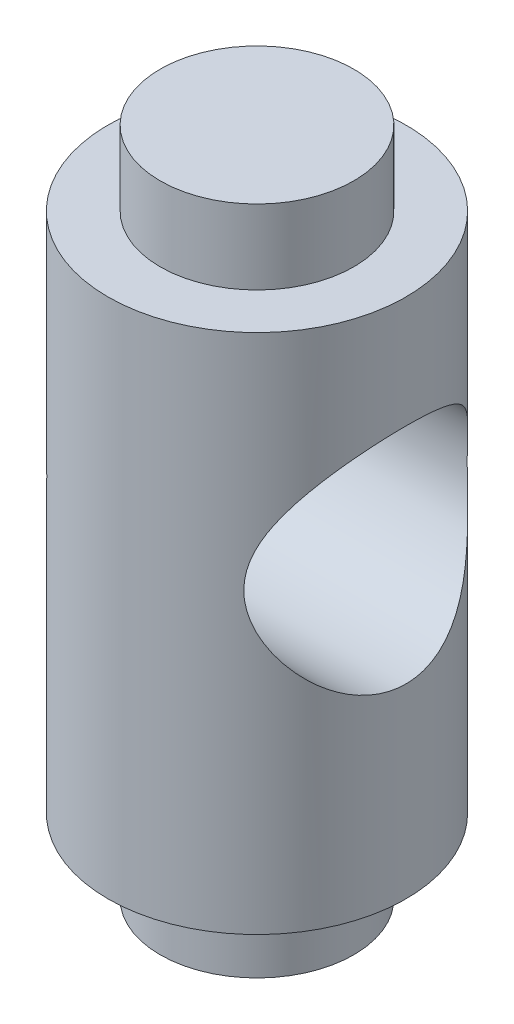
ISO-10303-21;
HEADER;
FILE_DESCRIPTION(('STEP AP214'),'2;1');
FILE_NAME('part.step','',(''),(''),'','','');
FILE_SCHEMA(('AUTOMOTIVE_DESIGN { 1 0 10303 214 1 1 1 1 }'));
ENDSEC;
DATA;
#1=APPLICATION_CONTEXT('core data for automotive mechanical design processes');
#2=APPLICATION_PROTOCOL_DEFINITION('international standard','automotive_design',2000,#1);
#3=PRODUCT_CONTEXT('',#1,'mechanical');
#4=PRODUCT('Part','Part','',(#3));
#5=PRODUCT_RELATED_PRODUCT_CATEGORY('part','',(#4));
#6=PRODUCT_DEFINITION_FORMATION('','',#4);
#7=PRODUCT_DEFINITION_CONTEXT('part definition',#1,'design');
#8=PRODUCT_DEFINITION('design','',#6,#7);
#9=PRODUCT_DEFINITION_SHAPE('','',#8);
#10=(LENGTH_UNIT() NAMED_UNIT(*) SI_UNIT(.MILLI.,.METRE.));
#11=(NAMED_UNIT(*) PLANE_ANGLE_UNIT() SI_UNIT($,.RADIAN.));
#12=(NAMED_UNIT(*) SI_UNIT($,.STERADIAN.) SOLID_ANGLE_UNIT());
#13=UNCERTAINTY_MEASURE_WITH_UNIT(LENGTH_MEASURE(1.E-05),#10,'distance_accuracy_value','');
#14=(GEOMETRIC_REPRESENTATION_CONTEXT(3) GLOBAL_UNCERTAINTY_ASSIGNED_CONTEXT((#13)) GLOBAL_UNIT_ASSIGNED_CONTEXT((#10,
#11,#12)) REPRESENTATION_CONTEXT('',''));
#15=CARTESIAN_POINT('',(0.,0.,0.));
#16=DIRECTION('',(0.,0.,1.));
#17=DIRECTION('',(1.,0.,0.));
#18=AXIS2_PLACEMENT_3D('',#15,#16,#17);
#19=CARTESIAN_POINT('',(0.,22.5,0.));
#20=DIRECTION('',(0.,1.,0.));
#21=DIRECTION('',(0.,0.,1.));
#22=AXIS2_PLACEMENT_3D('',#19,#20,#21);
#23=CYLINDRICAL_SURFACE('',#22,9.99999999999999);
#24=CARTESIAN_POINT('',(0.,-17.5,0.));
#25=DIRECTION('',(0.,1.,0.));
#26=DIRECTION('',(0.,0.,1.));
#27=AXIS2_PLACEMENT_3D('',#24,#25,#26);
#28=CIRCLE('',#27,9.99999999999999);
#29=CARTESIAN_POINT('',(0.,-17.5,9.99999999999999));
#30=VERTEX_POINT('',#29);
#31=EDGE_CURVE('E94',#30,#30,#28,.T.);
#32=ORIENTED_EDGE('',*,*,#31,.T.);
#33=EDGE_LOOP('',(#32));
#34=FACE_BOUND('',#33,.T.);
#35=CARTESIAN_POINT('',(0.,17.5,0.));
#36=DIRECTION('',(0.,1.,0.));
#37=DIRECTION('',(0.,0.,1.));
#38=AXIS2_PLACEMENT_3D('',#35,#36,#37);
#39=CIRCLE('',#38,9.99999999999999);
#40=CARTESIAN_POINT('',(0.,17.5,9.99999999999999));
#41=VERTEX_POINT('',#40);
#42=EDGE_CURVE('E96',#41,#41,#39,.T.);
#43=ORIENTED_EDGE('',*,*,#42,.F.);
#44=EDGE_LOOP('',(#43));
#45=FACE_BOUND('',#44,.T.);
#46=CARTESIAN_POINT('',(-6.61437827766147,2.5,7.5));
#47=CARTESIAN_POINT('',(-6.6143819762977,2.32495725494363,7.49999838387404));
#48=CARTESIAN_POINT('',(-6.62136678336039,2.1498808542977,7.4938544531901));
#49=CARTESIAN_POINT('',(-6.64887553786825,1.801629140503,7.46945630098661));
#50=CARTESIAN_POINT('',(-6.66940400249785,1.62845448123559,7.45119803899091));
#51=CARTESIAN_POINT('',(-6.72284656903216,1.28531073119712,7.40301431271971));
#52=CARTESIAN_POINT('',(-6.75578799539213,1.11534958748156,7.37306310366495));
#53=CARTESIAN_POINT('',(-6.83236869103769,0.780137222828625,7.30215402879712));
#54=CARTESIAN_POINT('',(-6.87601440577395,0.61488890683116,7.26118953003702));
#55=CARTESIAN_POINT('',(-6.97141228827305,0.292284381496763,7.16963772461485));
#56=CARTESIAN_POINT('',(-7.02303888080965,0.134848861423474,7.11919724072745));
#57=CARTESIAN_POINT('',(-7.13305481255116,-0.174192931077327,7.00896652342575));
#58=CARTESIAN_POINT('',(-7.19144339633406,-0.32579985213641,6.94917733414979));
#59=CARTESIAN_POINT('',(-7.37426489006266,-0.771608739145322,6.75658060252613));
#60=CARTESIAN_POINT('',(-7.50643092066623,-1.0570438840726,6.61047289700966));
#61=CARTESIAN_POINT('',(-7.72612312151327,-1.49541081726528,6.35008921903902));
#62=CARTESIAN_POINT('',(-7.8106651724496,-1.65615316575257,6.24603009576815));
#63=CARTESIAN_POINT('',(-7.98137144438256,-1.96871903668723,6.02636084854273));
#64=CARTESIAN_POINT('',(-8.06753579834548,-2.12054182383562,5.91074977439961));
#65=CARTESIAN_POINT('',(-8.23983652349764,-2.41520104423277,5.66809334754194));
#66=CARTESIAN_POINT('',(-8.32597267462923,-2.55802418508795,5.54103172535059));
#67=CARTESIAN_POINT('',(-8.49650996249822,-2.83408445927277,5.27581060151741));
#68=CARTESIAN_POINT('',(-8.58091109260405,-2.96732155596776,5.1376510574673));
#69=CARTESIAN_POINT('',(-8.76343118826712,-3.2499246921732,4.8210103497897));
#70=CARTESIAN_POINT('',(-8.86082412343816,-3.39701404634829,4.64006256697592));
#71=CARTESIAN_POINT('',(-9.04840053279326,-3.67528183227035,4.26272756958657));
#72=CARTESIAN_POINT('',(-9.13858238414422,-3.8064566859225,4.06633689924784));
#73=CARTESIAN_POINT('',(-9.30904597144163,-4.05103109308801,3.65927040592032));
#74=CARTESIAN_POINT('',(-9.389346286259,-4.16446411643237,3.44862258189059));
#75=CARTESIAN_POINT('',(-9.53775182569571,-4.37196979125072,3.01395872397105));
#76=CARTESIAN_POINT('',(-9.60586349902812,-4.4660526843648,2.78994984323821));
#77=CARTESIAN_POINT('',(-9.70920590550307,-4.60776033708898,2.39977112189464));
#78=CARTESIAN_POINT('',(-9.7481569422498,-4.66083762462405,2.23654263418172));
#79=CARTESIAN_POINT('',(-9.81827338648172,-4.75599960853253,1.90529321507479));
#80=CARTESIAN_POINT('',(-9.84944065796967,-4.7980869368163,1.73727344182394));
#81=CARTESIAN_POINT('',(-9.90335558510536,-4.87068804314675,1.39753765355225));
#82=CARTESIAN_POINT('',(-9.92610885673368,-4.90120954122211,1.22582418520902));
#83=CARTESIAN_POINT('',(-9.96274691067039,-4.95027468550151,0.879743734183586));
#84=CARTESIAN_POINT('',(-9.97663137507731,-4.96881790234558,0.705376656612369));
#85=CARTESIAN_POINT('',(-9.99524834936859,-4.99366784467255,0.354821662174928));
#86=CARTESIAN_POINT('',(-9.99995678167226,-4.99994237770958,0.178630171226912));
#87=CARTESIAN_POINT('',(-10.000042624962,-5.00005683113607,-0.173758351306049));
#88=CARTESIAN_POINT('',(-9.99542007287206,-4.99389680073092,-0.34995538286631));
#89=CARTESIAN_POINT('',(-9.97694670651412,-4.96923905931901,-0.701027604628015));
#90=CARTESIAN_POINT('',(-9.96309406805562,-4.95073890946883,-0.875902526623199));
#91=CARTESIAN_POINT('',(-9.9264665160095,-4.9016891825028,-1.22299713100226));
#92=CARTESIAN_POINT('',(-9.90369166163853,-4.87113968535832,-1.39521683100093));
#93=CARTESIAN_POINT('',(-9.85063449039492,-4.7996954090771,-1.72994463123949));
#94=CARTESIAN_POINT('',(-9.82063888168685,-4.759194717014,-1.89258265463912));
#95=CARTESIAN_POINT('',(-9.7533432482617,-4.66789010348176,-2.21341583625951));
#96=CARTESIAN_POINT('',(-9.71604068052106,-4.61708259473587,-2.37160942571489));
#97=CARTESIAN_POINT('',(-9.59413977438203,-4.45006274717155,-2.83823794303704));
#98=CARTESIAN_POINT('',(-9.49950846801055,-4.31920036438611,-3.13896269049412));
#99=CARTESIAN_POINT('',(-9.27804864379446,-4.00734387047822,-3.74612986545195));
#100=CARTESIAN_POINT('',(-9.14884335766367,-3.8224558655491,-4.0496657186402));
#101=CARTESIAN_POINT('',(-8.87301878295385,-3.41631511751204,-4.62284746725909));
#102=CARTESIAN_POINT('',(-8.72638468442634,-3.19503138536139,-4.89246413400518));
#103=CARTESIAN_POINT('',(-8.48504273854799,-2.81581411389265,-5.29480881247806));
#104=CARTESIAN_POINT('',(-8.39310925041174,-2.66809085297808,-5.43905294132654));
#105=CARTESIAN_POINT('',(-8.20797296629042,-2.36166142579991,-5.71460427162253));
#106=CARTESIAN_POINT('',(-8.11476992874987,-2.20295314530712,-5.84590897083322));
#107=CARTESIAN_POINT('',(-7.92914991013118,-1.87489703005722,-6.09530688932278));
#108=CARTESIAN_POINT('',(-7.83673337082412,-1.70554361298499,-6.21339308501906));
#109=CARTESIAN_POINT('',(-7.65507530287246,-1.35647449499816,-6.43587029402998));
#110=CARTESIAN_POINT('',(-7.56583306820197,-1.17676112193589,-6.54026436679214));
#111=CARTESIAN_POINT('',(-7.41026277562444,-0.843530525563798,-6.7155722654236));
#112=CARTESIAN_POINT('',(-7.34288681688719,-0.691837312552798,-6.78902852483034));
#113=CARTESIAN_POINT('',(-7.21353507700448,-0.381828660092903,-6.92631258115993));
#114=CARTESIAN_POINT('',(-7.1515610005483,-0.22351115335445,-6.9901373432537));
#115=CARTESIAN_POINT('',(-7.034994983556,0.0992189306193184,-7.10743795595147));
#116=CARTESIAN_POINT('',(-6.98039000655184,0.263620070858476,-7.16093215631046));
#117=CARTESIAN_POINT('',(-6.88048971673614,0.598266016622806,-7.25697383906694));
#118=CARTESIAN_POINT('',(-6.83518774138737,0.768506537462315,-7.29952916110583));
#119=CARTESIAN_POINT('',(-6.76376361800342,1.0798934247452,-7.36568941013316));
#120=CARTESIAN_POINT('',(-6.73562014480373,1.22013435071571,-7.39137773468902));
#121=CARTESIAN_POINT('',(-6.68761574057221,1.5031878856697,-7.43484020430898));
#122=CARTESIAN_POINT('',(-6.66775069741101,1.6459991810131,-7.45261827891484));
#123=CARTESIAN_POINT('',(-6.63708025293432,1.93325219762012,-7.47994591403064));
#124=CARTESIAN_POINT('',(-6.62626668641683,2.07769233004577,-7.48950289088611));
#125=CARTESIAN_POINT('',(-6.61412778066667,2.36728908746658,-7.50022540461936));
#126=CARTESIAN_POINT('',(-6.61280253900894,2.51244571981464,-7.50139085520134));
#127=CARTESIAN_POINT('',(-6.61970015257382,2.8023994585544,-7.49530453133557));
#128=CARTESIAN_POINT('',(-6.62792615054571,2.94719643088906,-7.4880499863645));
#129=CARTESIAN_POINT('',(-6.65357632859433,3.23530434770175,-7.46526710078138));
#130=CARTESIAN_POINT('',(-6.67100051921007,3.37861529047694,-7.44973875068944));
#131=CARTESIAN_POINT('',(-6.71437252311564,3.66300453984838,-7.41067135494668));
#132=CARTESIAN_POINT('',(-6.74033089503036,3.80407985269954,-7.38712238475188));
#133=CARTESIAN_POINT('',(-6.79983969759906,4.08317138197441,-7.33238101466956));
#134=CARTESIAN_POINT('',(-6.83339455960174,4.22118576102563,-7.30118415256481));
#135=CARTESIAN_POINT('',(-6.92081343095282,4.54453327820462,-7.21853070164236));
#136=CARTESIAN_POINT('',(-6.97758010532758,4.72826531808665,-7.16386030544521));
#137=CARTESIAN_POINT('',(-7.10070244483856,5.08816900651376,-7.04184138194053));
#138=CARTESIAN_POINT('',(-7.16706274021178,5.26433695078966,-6.97448672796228));
#139=CARTESIAN_POINT('',(-7.30690755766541,5.60897695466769,-6.82783857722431));
#140=CARTESIAN_POINT('',(-7.38040159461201,5.77743828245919,-6.74852905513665));
#141=CARTESIAN_POINT('',(-7.53219738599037,6.10628224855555,-6.57867589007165));
#142=CARTESIAN_POINT('',(-7.61049870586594,6.26666561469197,-6.48813326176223));
#143=CARTESIAN_POINT('',(-7.77280857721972,6.58484159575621,-6.29286343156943));
#144=CARTESIAN_POINT('',(-7.85692102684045,6.74234264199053,-6.1877481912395));
#145=CARTESIAN_POINT('',(-8.02641315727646,7.04857908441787,-5.96625095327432));
#146=CARTESIAN_POINT('',(-8.11179326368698,7.19731144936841,-5.8498650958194));
#147=CARTESIAN_POINT('',(-8.28217070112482,7.48576938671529,-5.60604802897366));
#148=CARTESIAN_POINT('',(-8.36716790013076,7.62549204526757,-5.47861327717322));
#149=CARTESIAN_POINT('',(-8.53523072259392,7.8954907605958,-5.21292172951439));
#150=CARTESIAN_POINT('',(-8.61829632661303,8.02576672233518,-5.07466482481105));
#151=CARTESIAN_POINT('',(-8.79886280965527,8.3037464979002,-4.75609627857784));
#152=CARTESIAN_POINT('',(-8.89555017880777,8.4490352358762,-4.57319795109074));
#153=CARTESIAN_POINT('',(-9.08140583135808,8.72351369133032,-4.19202039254));
#154=CARTESIAN_POINT('',(-9.17057240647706,8.85269975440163,-3.99373768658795));
#155=CARTESIAN_POINT('',(-9.33871511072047,9.09309973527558,-3.58295524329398));
#156=CARTESIAN_POINT('',(-9.41770839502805,9.20434399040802,-3.37048038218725));
#157=CARTESIAN_POINT('',(-9.56319061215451,9.40721459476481,-2.93233430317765));
#158=CARTESIAN_POINT('',(-9.62968629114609,9.49885153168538,-2.7066702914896));
#159=CARTESIAN_POINT('',(-9.72986513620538,9.63594683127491,-2.31458682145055));
#160=CARTESIAN_POINT('',(-9.76737290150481,9.68696832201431,-2.15106438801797));
#161=CARTESIAN_POINT('',(-9.83454643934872,9.77799769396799,-1.81942149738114));
#162=CARTESIAN_POINT('',(-9.8642140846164,9.81800820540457,-1.6513021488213));
#163=CARTESIAN_POINT('',(-9.91510086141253,9.88645709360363,-1.31158500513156));
#164=CARTESIAN_POINT('',(-9.93632589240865,9.91490355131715,-1.13998972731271));
#165=CARTESIAN_POINT('',(-9.96991081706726,9.95984888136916,-0.794368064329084));
#166=CARTESIAN_POINT('',(-9.98227037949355,9.97634730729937,-0.620341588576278));
#167=CARTESIAN_POINT('',(-9.99786922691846,9.99716192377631,-0.270737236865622));
#168=CARTESIAN_POINT('',(-10.0010868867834,10.0014492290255,-0.0951566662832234));
#169=CARTESIAN_POINT('',(-9.99826797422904,9.99769057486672,0.25579645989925));
#170=CARTESIAN_POINT('',(-9.99223144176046,9.9896446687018,0.431169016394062));
#171=CARTESIAN_POINT('',(-9.97103698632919,9.96134480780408,0.780405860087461));
#172=CARTESIAN_POINT('',(-9.95587700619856,9.94108809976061,0.954269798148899));
#173=CARTESIAN_POINT('',(-9.91676635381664,9.88867771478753,1.29918219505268));
#174=CARTESIAN_POINT('',(-9.89281570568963,9.85652407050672,1.47023066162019));
#175=CARTESIAN_POINT('',(-9.83744673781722,9.78189307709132,1.80341707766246));
#176=CARTESIAN_POINT('',(-9.8062681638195,9.73974634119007,1.96566921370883));
#177=CARTESIAN_POINT('',(-9.7366786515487,9.64520309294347,2.28559292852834));
#178=CARTESIAN_POINT('',(-9.69826518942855,9.59280300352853,2.44326288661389));
#179=CARTESIAN_POINT('',(-9.57316299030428,9.4211022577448,2.90814334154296));
#180=CARTESIAN_POINT('',(-9.47657095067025,9.28724605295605,3.20746548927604));
#181=CARTESIAN_POINT('',(-9.25087814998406,8.9686016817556,3.81278372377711));
#182=CARTESIAN_POINT('',(-9.11933431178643,8.7797616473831,4.11569486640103));
#183=CARTESIAN_POINT('',(-8.83925861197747,8.36565147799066,4.68708538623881));
#184=CARTESIAN_POINT('',(-8.69071117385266,8.14034786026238,4.95553270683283));
#185=CARTESIAN_POINT('',(-8.44671829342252,7.75447653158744,5.35573297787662));
#186=CARTESIAN_POINT('',(-8.3538469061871,7.60414606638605,5.49915593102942));
#187=CARTESIAN_POINT('',(-8.16710630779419,7.29241369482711,5.7728494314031));
#188=CARTESIAN_POINT('',(-8.07323689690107,7.13100953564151,5.90311728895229));
#189=CARTESIAN_POINT('',(-7.88663999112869,6.79746571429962,6.15019469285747));
#190=CARTESIAN_POINT('',(-7.79391302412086,6.62532129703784,6.26699821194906));
#191=CARTESIAN_POINT('',(-7.61208490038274,6.2705492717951,6.48663766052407));
#192=CARTESIAN_POINT('',(-7.52298281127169,6.08792438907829,6.58947719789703));
#193=CARTESIAN_POINT('',(-7.36980342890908,5.75286478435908,6.75989283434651));
#194=CARTESIAN_POINT('',(-7.30447828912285,5.60243084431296,6.83028750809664));
#195=CARTESIAN_POINT('',(-7.17937554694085,5.29519765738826,6.9616658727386));
#196=CARTESIAN_POINT('',(-7.11959923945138,5.13839693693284,7.02264736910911));
#197=CARTESIAN_POINT('',(-7.00753877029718,4.81902463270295,7.1344699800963));
#198=CARTESIAN_POINT('',(-6.95523768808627,4.65646715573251,7.18533410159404));
#199=CARTESIAN_POINT('',(-6.85992197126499,4.32582318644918,7.2763865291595));
#200=CARTESIAN_POINT('',(-6.81690335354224,4.15773910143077,7.31657941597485));
#201=CARTESIAN_POINT('',(-6.72665035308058,3.74611764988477,7.39982855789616));
#202=CARTESIAN_POINT('',(-6.685011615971,3.50008621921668,7.4372125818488));
#203=CARTESIAN_POINT('',(-6.64288211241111,3.12710902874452,7.47478587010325));
#204=CARTESIAN_POINT('',(-6.63222701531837,3.00212059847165,7.48422651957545));
#205=CARTESIAN_POINT('',(-6.61797427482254,2.75142716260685,7.49683371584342));
#206=CARTESIAN_POINT('',(-6.61437562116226,2.62572226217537,7.50000116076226));
#207=CARTESIAN_POINT('',(-6.61437827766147,2.5,7.5));
#208=B_SPLINE_CURVE_WITH_KNOTS('',3,(#46,#47,#48,#49,#50,#51,#52,#53,#54,#55,#56,#57,#58,#59,
#60,#61,#62,#63,#64,#65,#66,#67,#68,#69,#70,#71,#72,#73,#74,#75,#76,#77,#78,#79,#80,#81,#82,#83,
#84,#85,#86,#87,#88,#89,#90,#91,#92,#93,#94,#95,#96,#97,#98,#99,#100,#101,#102,#103,#104,#105,
#106,#107,#108,#109,#110,#111,#112,#113,#114,#115,#116,#117,#118,#119,#120,#121,#122,#123,#124,
#125,#126,#127,#128,#129,#130,#131,#132,#133,#134,#135,#136,#137,#138,#139,#140,#141,#142,#143,
#144,#145,#146,#147,#148,#149,#150,#151,#152,#153,#154,#155,#156,#157,#158,#159,#160,#161,#162,
#163,#164,#165,#166,#167,#168,#169,#170,#171,#172,#173,#174,#175,#176,#177,#178,#179,#180,#181,
#182,#183,#184,#185,#186,#187,#188,#189,#190,#191,#192,#193,#194,#195,#196,#197,#198,#199,#200,
#201,#202,#203,#204,#205,#206,#207),.UNSPECIFIED.,.T.,.F.,(4,2,2,2,2,2,2,2,2,2,2,2,2,2,2,2,2,2,
2,2,2,2,2,2,2,2,2,2,2,2,2,2,2,2,2,2,2,2,2,2,2,2,2,2,2,2,2,2,2,2,2,2,2,2,2,2,2,2,2,2,2,2,2,2,2,2,
2,2,2,2,2,2,2,2,2,2,2,2,2,2,4),(0.,0.524946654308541,1.05006848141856,1.57635306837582,
2.10295533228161,2.62198622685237,3.14095919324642,4.17811218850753,4.80566508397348,
5.43326964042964,6.061780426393,6.69029361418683,7.44738762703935,8.20465154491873,
8.96046919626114,9.71588577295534,10.2433789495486,10.7707456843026,11.2977597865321,
11.8247927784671,12.3532068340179,12.8816187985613,13.4101352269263,13.9386481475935,
14.448892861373,14.9593154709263,15.9794159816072,17.1099698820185,18.2414914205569,
18.9189650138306,19.5965693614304,20.2745320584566,20.9523430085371,21.4964710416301,
22.0407701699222,22.5840934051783,23.1270261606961,23.5625720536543,23.9979013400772,
24.4328374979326,24.8677781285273,25.3028619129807,25.7379461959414,26.1735708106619,
26.609450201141,27.2082971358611,27.8074340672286,28.4073813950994,29.0072745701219,
29.6283553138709,30.2496495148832,30.8711436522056,31.4926440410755,32.2499956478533,
33.0075188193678,33.7637473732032,34.5195665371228,35.0451096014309,35.57052701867,
36.0955766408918,36.6206458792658,37.1469561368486,37.6732641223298,38.1996908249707,
38.7261160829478,39.2370944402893,39.7482513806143,40.7698210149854,41.9071133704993,
43.045456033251,43.7276445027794,44.4099721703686,45.0926041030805,45.7750593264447,
46.3100858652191,46.8452369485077,47.3791568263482,47.9128471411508,48.6669364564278,
49.044026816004,49.4210631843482),.UNSPECIFIED.);
#209=CARTESIAN_POINT('',(-6.61437827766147,2.5,7.5));
#210=VERTEX_POINT('',#209);
#211=EDGE_CURVE('E47',#210,#210,#208,.T.);
#212=ORIENTED_EDGE('',*,*,#211,.T.);
#213=EDGE_LOOP('',(#212));
#214=FACE_BOUND('',#213,.T.);
#215=CARTESIAN_POINT('',(9.99999999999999,10.,0.));
#216=CARTESIAN_POINT('',(9.99999825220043,9.99999818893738,-0.183148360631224));
#217=CARTESIAN_POINT('',(9.99495621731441,9.99327904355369,-0.366342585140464));
#218=CARTESIAN_POINT('',(9.97490143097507,9.9665075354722,-0.731284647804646));
#219=CARTESIAN_POINT('',(9.95988271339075,9.94644719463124,-0.913031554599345));
#220=CARTESIAN_POINT('',(9.9201917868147,9.89327524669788,-1.27389276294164));
#221=CARTESIAN_POINT('',(9.89550118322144,9.86013876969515,-1.45300136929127));
#222=CARTESIAN_POINT('',(9.83702172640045,9.78132496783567,-1.8069893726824));
#223=CARTESIAN_POINT('',(9.80322881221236,9.73564204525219,-1.98186684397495));
#224=CARTESIAN_POINT('',(9.72752378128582,9.63273632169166,-2.32506995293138));
#225=CARTESIAN_POINT('',(9.6856665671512,9.57559145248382,-2.49343113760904));
#226=CARTESIAN_POINT('',(9.59451489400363,9.45029166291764,-2.82395570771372));
#227=CARTESIAN_POINT('',(9.5452174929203,9.38213238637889,-2.98611660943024));
#228=CARTESIAN_POINT('',(9.38756843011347,9.16235213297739,-3.46192400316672));
#229=CARTESIAN_POINT('',(9.26935773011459,8.99529215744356,-3.76534217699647));
#230=CARTESIAN_POINT('',(9.00247083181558,8.60867070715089,-4.36738031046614));
#231=CARTESIAN_POINT('',(8.85198712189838,8.38568000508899,-4.66295396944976));
#232=CARTESIAN_POINT('',(8.53832916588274,7.90250413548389,-5.21514803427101));
#233=CARTESIAN_POINT('',(8.37513550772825,7.64226154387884,-5.47170701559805));
#234=CARTESIAN_POINT('',(8.1123054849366,7.19866075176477,-5.84983236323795));
#235=CARTESIAN_POINT('',(8.01322272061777,7.0259238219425,-5.98448699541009));
#236=CARTESIAN_POINT('',(7.81692237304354,6.66852807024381,-6.23870842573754));
#237=CARTESIAN_POINT('',(7.71970535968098,6.48386567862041,-6.35827067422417));
#238=CARTESIAN_POINT('',(7.53024443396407,6.10302886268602,-6.58155279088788));
#239=CARTESIAN_POINT('',(7.43799561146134,5.90686622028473,-6.68528849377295));
#240=CARTESIAN_POINT('',(7.26194992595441,5.50315708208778,-6.87611265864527));
#241=CARTESIAN_POINT('',(7.17814826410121,5.29561715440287,-6.96321059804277));
#242=CARTESIAN_POINT('',(6.99885956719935,4.80254645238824,-7.14400878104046));
#243=CARTESIAN_POINT('',(6.90787299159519,4.51287098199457,-7.23130376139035));
#244=CARTESIAN_POINT('',(6.79582705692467,4.06653027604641,-7.33616747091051));
#245=CARTESIAN_POINT('',(6.7625626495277,3.91586731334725,-7.36676563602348));
#246=CARTESIAN_POINT('',(6.70541097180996,3.61124833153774,-7.41882486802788));
#247=CARTESIAN_POINT('',(6.68151886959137,3.45729405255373,-7.44029064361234));
#248=CARTESIAN_POINT('',(6.64399487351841,3.14561532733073,-7.4738195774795));
#249=CARTESIAN_POINT('',(6.63046224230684,2.98786898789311,-7.48579180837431));
#250=CARTESIAN_POINT('',(6.61471013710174,2.67136642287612,-7.49971481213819));
#251=CARTESIAN_POINT('',(6.61249035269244,2.51261022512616,-7.50166585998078));
#252=CARTESIAN_POINT('',(6.61948621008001,2.19549295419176,-7.49549374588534));
#253=CARTESIAN_POINT('',(6.62870559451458,2.03713202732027,-7.48736728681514));
#254=CARTESIAN_POINT('',(6.65809333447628,1.72229320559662,-7.46124382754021));
#255=CARTESIAN_POINT('',(6.67826180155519,1.56581532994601,-7.44324672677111));
#256=CARTESIAN_POINT('',(6.74840995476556,1.13425031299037,-7.37988631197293));
#257=CARTESIAN_POINT('',(6.80936438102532,0.862394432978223,-7.32413018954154));
#258=CARTESIAN_POINT('',(6.95570310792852,0.332729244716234,-7.18527767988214));
#259=CARTESIAN_POINT('',(7.04111087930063,0.0749337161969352,-7.10215501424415));
#260=CARTESIAN_POINT('',(7.21099153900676,-0.378169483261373,-6.92917382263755));
#261=CARTESIAN_POINT('',(7.29266351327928,-0.576159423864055,-6.84346833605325));
#262=CARTESIAN_POINT('',(7.46342165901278,-0.961580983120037,-6.65682611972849));
#263=CARTESIAN_POINT('',(7.5525116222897,-1.14900711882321,-6.55588157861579));
#264=CARTESIAN_POINT('',(7.73517823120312,-1.51346383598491,-6.33933222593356));
#265=CARTESIAN_POINT('',(7.82876380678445,-1.69047202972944,-6.22369741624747));
#266=CARTESIAN_POINT('',(8.01761553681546,-2.03350288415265,-5.97844426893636));
#267=CARTESIAN_POINT('',(8.11288142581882,-2.19952726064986,-5.84882812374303));
#268=CARTESIAN_POINT('',(8.30521453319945,-2.52435495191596,-5.57247402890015));
#269=CARTESIAN_POINT('',(8.4022664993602,-2.68287009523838,-5.42538639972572));
#270=CARTESIAN_POINT('',(8.59350313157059,-2.9874712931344,-5.11709028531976));
#271=CARTESIAN_POINT('',(8.68768750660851,-3.13355608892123,-4.95588037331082));
#272=CARTESIAN_POINT('',(8.87089324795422,-3.4121685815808,-4.61993509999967));
#273=CARTESIAN_POINT('',(8.95992308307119,-3.54471880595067,-4.44522309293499));
#274=CARTESIAN_POINT('',(9.13090472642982,-3.79538049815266,-4.0824934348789));
#275=CARTESIAN_POINT('',(9.21285834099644,-3.91349565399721,-3.89447920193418));
#276=CARTESIAN_POINT('',(9.35211813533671,-4.11181062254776,-3.54483535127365));
#277=CARTESIAN_POINT('',(9.41107137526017,-4.19486397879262,-3.3854749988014));
#278=CARTESIAN_POINT('',(9.52211460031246,-4.35008087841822,-3.05924910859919));
#279=CARTESIAN_POINT('',(9.57420599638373,-4.42224666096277,-2.89238512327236));
#280=CARTESIAN_POINT('',(9.67052015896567,-4.55485907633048,-2.55192522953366));
#281=CARTESIAN_POINT('',(9.71474587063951,-4.61531009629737,-2.37833187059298));
#282=CARTESIAN_POINT('',(9.79443033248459,-4.72372599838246,-2.0253079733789));
#283=CARTESIAN_POINT('',(9.82988897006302,-4.77169072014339,-1.84587736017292));
#284=CARTESIAN_POINT('',(9.89142668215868,-4.85466532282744,-1.48124003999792));
#285=CARTESIAN_POINT('',(9.91744578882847,-4.88959241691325,-1.29600425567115));
#286=CARTESIAN_POINT('',(9.95915423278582,-4.94547510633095,-0.922276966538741));
#287=CARTESIAN_POINT('',(9.97484354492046,-4.96643066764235,-0.733785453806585));
#288=CARTESIAN_POINT('',(9.99548555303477,-4.99398524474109,-0.355230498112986));
#289=CARTESIAN_POINT('',(10.0004418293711,-5.00058904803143,-0.165167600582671));
#290=CARTESIAN_POINT('',(9.99949640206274,-4.99932859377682,0.214874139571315));
#291=CARTESIAN_POINT('',(9.99359555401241,-4.99146547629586,0.40485298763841));
#292=CARTESIAN_POINT('',(9.97223305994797,-4.96294236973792,0.763928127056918));
#293=CARTESIAN_POINT('',(9.9577961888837,-4.94365365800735,0.933197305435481));
#294=CARTESIAN_POINT('',(9.92057133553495,-4.89378195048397,1.26918880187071));
#295=CARTESIAN_POINT('',(9.89778056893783,-4.86319518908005,1.43591025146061));
#296=CARTESIAN_POINT('',(9.84430767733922,-4.79115734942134,1.76564432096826));
#297=CARTESIAN_POINT('',(9.81362747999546,-4.7497089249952,1.92865783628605));
#298=CARTESIAN_POINT('',(9.74493618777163,-4.65644992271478,2.25016822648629));
#299=CARTESIAN_POINT('',(9.70692222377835,-4.60463528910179,2.40866330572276));
#300=CARTESIAN_POINT('',(9.62279034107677,-4.48925664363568,2.72575422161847));
#301=CARTESIAN_POINT('',(9.57643622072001,-4.42534617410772,2.88416117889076));
#302=CARTESIAN_POINT('',(9.47738924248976,-4.28772294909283,3.19463271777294));
#303=CARTESIAN_POINT('',(9.42469423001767,-4.214006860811,3.34669511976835));
#304=CARTESIAN_POINT('',(9.25839398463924,-3.97920692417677,3.79243668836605));
#305=CARTESIAN_POINT('',(9.13650809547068,-3.80438302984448,4.0759094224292));
#306=CARTESIAN_POINT('',(8.855926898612,-3.39103887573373,4.65763303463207));
#307=CARTESIAN_POINT('',(8.69448369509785,-3.1467569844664,4.95044606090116));
#308=CARTESIAN_POINT('',(8.44516881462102,-2.75178529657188,5.35767107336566));
#309=CARTESIAN_POINT('',(8.36074234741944,-2.61514721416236,5.48824918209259));
#310=CARTESIAN_POINT('',(8.19100904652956,-2.33274071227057,5.73848345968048));
#311=CARTESIAN_POINT('',(8.10570242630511,-2.18697446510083,5.85814221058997));
#312=CARTESIAN_POINT('',(7.91961196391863,-1.85798360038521,6.10806144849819));
#313=CARTESIAN_POINT('',(7.81897317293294,-1.67291057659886,6.23600392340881));
#314=CARTESIAN_POINT('',(7.62168627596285,-1.29037795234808,6.47564568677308));
#315=CARTESIAN_POINT('',(7.52503964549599,-1.09291383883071,6.58733900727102));
#316=CARTESIAN_POINT('',(7.33958950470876,-0.686260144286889,6.79334858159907));
#317=CARTESIAN_POINT('',(7.2507678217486,-0.47709968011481,6.8877056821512));
#318=CARTESIAN_POINT('',(7.08503810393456,-0.046968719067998,7.0580703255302));
#319=CARTESIAN_POINT('',(7.00812021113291,0.173991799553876,7.13409308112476));
#320=CARTESIAN_POINT('',(6.89776536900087,0.538736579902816,7.24045739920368));
#321=CARTESIAN_POINT('',(6.85905105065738,0.679121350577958,7.27706722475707));
#322=CARTESIAN_POINT('',(6.78909215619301,0.963526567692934,7.34237828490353));
#323=CARTESIAN_POINT('',(6.75784495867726,1.10754571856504,7.37108229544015));
#324=CARTESIAN_POINT('',(6.70397772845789,1.39832714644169,7.42010866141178));
#325=CARTESIAN_POINT('',(6.68134175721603,1.54508382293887,7.4404465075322));
#326=CARTESIAN_POINT('',(6.64553659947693,1.84070221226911,7.47244433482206));
#327=CARTESIAN_POINT('',(6.63236743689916,1.98956393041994,7.48410429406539));
#328=CARTESIAN_POINT('',(6.6160439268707,2.28904561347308,7.49853887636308));
#329=CARTESIAN_POINT('',(6.61294157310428,2.43967068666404,7.5012673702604));
#330=CARTESIAN_POINT('',(6.61704410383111,2.74066507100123,7.49764855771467));
#331=CARTESIAN_POINT('',(6.6242487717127,2.89103438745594,7.49130144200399));
#332=CARTESIAN_POINT('',(6.64864042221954,3.19044033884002,7.46966150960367));
#333=CARTESIAN_POINT('',(6.66583653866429,3.3394756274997,7.45436050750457));
#334=CARTESIAN_POINT('',(6.70947271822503,3.63508703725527,7.41510828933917));
#335=CARTESIAN_POINT('',(6.73591768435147,3.781661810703,7.39115248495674));
#336=CARTESIAN_POINT('',(6.80366991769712,4.10301856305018,7.32888993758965));
#337=CARTESIAN_POINT('',(6.84695911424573,4.27699756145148,7.28859466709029));
#338=CARTESIAN_POINT('',(6.94360749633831,4.6191194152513,7.19657956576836));
#339=CARTESIAN_POINT('',(6.99697427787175,4.78725775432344,7.14485111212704));
#340=CARTESIAN_POINT('',(7.11173285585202,5.11739484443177,7.03063417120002));
#341=CARTESIAN_POINT('',(7.17314049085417,5.27938064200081,6.96812436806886));
#342=CARTESIAN_POINT('',(7.30189696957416,5.59656264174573,6.83308175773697));
#343=CARTESIAN_POINT('',(7.36924400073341,5.75176089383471,6.76055200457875));
#344=CARTESIAN_POINT('',(7.53227527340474,6.10808559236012,6.57908862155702));
#345=CARTESIAN_POINT('',(7.62967949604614,6.30644895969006,6.46625899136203));
#346=CARTESIAN_POINT('',(7.82848797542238,6.69073439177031,6.22409397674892));
#347=CARTESIAN_POINT('',(7.92989347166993,6.87665255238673,6.09475344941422));
#348=CARTESIAN_POINT('',(8.13368678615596,7.23589981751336,5.82000166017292));
#349=CARTESIAN_POINT('',(8.23607528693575,7.40921933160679,5.67457836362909));
#350=CARTESIAN_POINT('',(8.43902615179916,7.74257893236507,5.36811116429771));
#351=CARTESIAN_POINT('',(8.53958873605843,7.9026206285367,5.20706915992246));
#352=CARTESIAN_POINT('',(8.73722404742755,8.20990657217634,4.86823444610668));
#353=CARTESIAN_POINT('',(8.83426032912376,8.35703192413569,4.69031229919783));
#354=CARTESIAN_POINT('',(9.02148209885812,8.63577999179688,4.31926384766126));
#355=CARTESIAN_POINT('',(9.11166669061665,8.76740068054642,4.12613556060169));
#356=CARTESIAN_POINT('',(9.28256253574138,9.01335316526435,3.72576429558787));
#357=CARTESIAN_POINT('',(9.36329167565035,9.12771772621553,3.51854917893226));
#358=CARTESIAN_POINT('',(9.51304471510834,9.33764805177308,3.09083237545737));
#359=CARTESIAN_POINT('',(9.58207465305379,9.43322351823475,2.87033762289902));
#360=CARTESIAN_POINT('',(9.68796526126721,9.5787264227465,2.48412405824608));
#361=CARTESIAN_POINT('',(9.72832482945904,9.63382299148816,2.32129005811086));
#362=CARTESIAN_POINT('',(9.80132549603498,9.73305703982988,1.99064201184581));
#363=CARTESIAN_POINT('',(9.83396846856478,9.77719718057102,1.82282918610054));
#364=CARTESIAN_POINT('',(9.89082818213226,9.85385209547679,1.48358839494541));
#365=CARTESIAN_POINT('',(9.91506439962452,9.88639374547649,1.31216977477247));
#366=CARTESIAN_POINT('',(9.95469855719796,9.93951195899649,0.966540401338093));
#367=CARTESIAN_POINT('',(9.97010101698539,9.96009464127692,0.792331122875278));
#368=CARTESIAN_POINT('',(9.98726751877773,9.98301680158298,0.514835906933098));
#369=CARTESIAN_POINT('',(9.99203792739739,9.98938115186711,0.412044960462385));
#370=CARTESIAN_POINT('',(9.9984049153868,9.99787360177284,0.206174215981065));
#371=CARTESIAN_POINT('',(10.0000009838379,10.0000010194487,0.103094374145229));
#372=CARTESIAN_POINT('',(9.99999999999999,10.,0.));
#373=B_SPLINE_CURVE_WITH_KNOTS('',3,(#215,#216,#217,#218,#219,#220,#221,#222,#223,#224,#225,
#226,#227,#228,#229,#230,#231,#232,#233,#234,#235,#236,#237,#238,#239,#240,#241,#242,#243,#244,
#245,#246,#247,#248,#249,#250,#251,#252,#253,#254,#255,#256,#257,#258,#259,#260,#261,#262,#263,
#264,#265,#266,#267,#268,#269,#270,#271,#272,#273,#274,#275,#276,#277,#278,#279,#280,#281,#282,
#283,#284,#285,#286,#287,#288,#289,#290,#291,#292,#293,#294,#295,#296,#297,#298,#299,#300,#301,
#302,#303,#304,#305,#306,#307,#308,#309,#310,#311,#312,#313,#314,#315,#316,#317,#318,#319,#320,
#321,#322,#323,#324,#325,#326,#327,#328,#329,#330,#331,#332,#333,#334,#335,#336,#337,#338,#339,
#340,#341,#342,#343,#344,#345,#346,#347,#348,#349,#350,#351,#352,#353,#354,#355,#356,#357,#358,
#359,#360,#361,#362,#363,#364,#365,#366,#367,#368,#369,#370,#371,#372),.UNSPECIFIED.,.T.,.F.,(4,
2,2,2,2,2,2,2,2,2,2,2,2,2,2,2,2,2,2,2,2,2,2,2,2,2,2,2,2,2,2,2,2,2,2,2,2,2,2,2,2,2,2,2,2,2,2,2,2,
2,2,2,2,2,2,2,2,2,2,2,2,2,2,2,2,2,2,2,2,2,2,2,2,2,2,2,2,2,4),(0.,0.549333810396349,
1.09899642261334,1.64970953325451,2.20066875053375,2.74800168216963,3.29555161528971,
4.38923194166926,5.58419151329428,6.78101336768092,7.50152042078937,8.22224415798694,
8.94224200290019,9.66182848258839,10.6057257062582,11.0771415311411,11.5483139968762,
12.0239465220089,12.4995659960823,12.9753411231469,13.4511210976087,14.3000658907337,
15.1498282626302,15.8409837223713,16.5324946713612,17.2254411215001,17.9182790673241,
18.6286106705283,19.3390141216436,20.0482151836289,20.7572346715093,21.3240789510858,
21.8908064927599,22.4573213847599,23.0238435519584,23.5939042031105,24.163966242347,
24.733838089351,25.3036650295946,25.8159956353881,26.3284971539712,26.8408735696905,
27.3534508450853,27.8838865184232,28.4145029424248,29.4749536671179,30.7125000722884,
31.3331067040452,31.9535662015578,32.6921380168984,33.4309804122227,34.168059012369,
34.9045239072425,35.3546199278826,35.804557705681,36.2536585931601,36.7027606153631,
37.1541785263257,37.6055869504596,38.0574086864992,38.5094703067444,39.0599080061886,
39.610762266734,40.1627183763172,40.7145066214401,41.457880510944,42.2014865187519,
42.9456527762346,43.6897286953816,44.440059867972,45.1904890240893,45.9394748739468,
46.6880729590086,47.2172824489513,47.7463632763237,48.2742100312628,48.801786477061,
49.1109572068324,49.4201776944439),.UNSPECIFIED.);
#374=CARTESIAN_POINT('',(9.99999999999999,10.,0.));
#375=VERTEX_POINT('',#374);
#376=EDGE_CURVE('E10',#375,#375,#373,.T.);
#377=ORIENTED_EDGE('',*,*,#376,.T.);
#378=EDGE_LOOP('',(#377));
#379=FACE_BOUND('',#378,.T.);
#380=ADVANCED_FACE('F35',(#34,#45,#214,#379),#23,.T.);
#381=CARTESIAN_POINT('',(-6.5,22.5,0.));
#382=DIRECTION('',(0.,1.,0.));
#383=DIRECTION('',(0.,0.,1.));
#384=AXIS2_PLACEMENT_3D('',#381,#382,#383);
#385=PLANE('',#384);
#386=CARTESIAN_POINT('',(0.,22.5,0.));
#387=DIRECTION('',(0.,1.,0.));
#388=DIRECTION('',(0.,0.,1.));
#389=AXIS2_PLACEMENT_3D('',#386,#387,#388);
#390=CIRCLE('',#389,6.5);
#391=CARTESIAN_POINT('',(0.,22.5,6.5));
#392=VERTEX_POINT('',#391);
#393=EDGE_CURVE('E101',#392,#392,#390,.T.);
#394=ORIENTED_EDGE('',*,*,#393,.T.);
#395=EDGE_LOOP('',(#394));
#396=FACE_BOUND('',#395,.T.);
#397=ADVANCED_FACE('F37',(#396),#385,.T.);
#398=CARTESIAN_POINT('',(0.,-22.5,0.));
#399=DIRECTION('',(0.,-1.,0.));
#400=DIRECTION('',(0.,0.,-1.));
#401=AXIS2_PLACEMENT_3D('',#398,#399,#400);
#402=PLANE('',#401);
#403=CARTESIAN_POINT('',(0.,-22.5,0.));
#404=DIRECTION('',(0.,1.,0.));
#405=DIRECTION('',(0.,0.,1.));
#406=AXIS2_PLACEMENT_3D('',#403,#404,#405);
#407=CIRCLE('',#406,6.5);
#408=CARTESIAN_POINT('',(0.,-22.5,6.5));
#409=VERTEX_POINT('',#408);
#410=EDGE_CURVE('E51',#409,#409,#407,.T.);
#411=ORIENTED_EDGE('',*,*,#410,.F.);
#412=EDGE_LOOP('',(#411));
#413=FACE_BOUND('',#412,.T.);
#414=ADVANCED_FACE('F89',(#413),#402,.T.);
#415=CARTESIAN_POINT('',(0.,22.5,0.));
#416=DIRECTION('',(0.,1.,0.));
#417=DIRECTION('',(0.,0.,1.));
#418=AXIS2_PLACEMENT_3D('',#415,#416,#417);
#419=CYLINDRICAL_SURFACE('',#418,6.5);
#420=ORIENTED_EDGE('',*,*,#410,.T.);
#421=EDGE_LOOP('',(#420));
#422=FACE_BOUND('',#421,.T.);
#423=CARTESIAN_POINT('',(0.,-17.5,0.));
#424=DIRECTION('',(0.,1.,0.));
#425=DIRECTION('',(0.,0.,1.));
#426=AXIS2_PLACEMENT_3D('',#423,#424,#425);
#427=CIRCLE('',#426,6.5);
#428=CARTESIAN_POINT('',(0.,-17.5,6.5));
#429=VERTEX_POINT('',#428);
#430=EDGE_CURVE('E55',#429,#429,#427,.T.);
#431=ORIENTED_EDGE('',*,*,#430,.F.);
#432=EDGE_LOOP('',(#431));
#433=FACE_BOUND('',#432,.T.);
#434=ADVANCED_FACE('F80',(#422,#433),#419,.T.);
#435=CARTESIAN_POINT('',(-6.5,-17.5,0.));
#436=DIRECTION('',(0.,-1.,0.));
#437=DIRECTION('',(0.,0.,-1.));
#438=AXIS2_PLACEMENT_3D('',#435,#436,#437);
#439=PLANE('',#438);
#440=ORIENTED_EDGE('',*,*,#430,.T.);
#441=EDGE_LOOP('',(#440));
#442=FACE_BOUND('',#441,.T.);
#443=ORIENTED_EDGE('',*,*,#31,.F.);
#444=EDGE_LOOP('',(#443));
#445=FACE_BOUND('',#444,.T.);
#446=ADVANCED_FACE('F75',(#442,#445),#439,.T.);
#447=CARTESIAN_POINT('',(-9.99999999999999,17.5,0.));
#448=DIRECTION('',(0.,1.,0.));
#449=DIRECTION('',(0.,0.,1.));
#450=AXIS2_PLACEMENT_3D('',#447,#448,#449);
#451=PLANE('',#450);
#452=ORIENTED_EDGE('',*,*,#42,.T.);
#453=EDGE_LOOP('',(#452));
#454=FACE_BOUND('',#453,.T.);
#455=CARTESIAN_POINT('',(0.,17.5,0.));
#456=DIRECTION('',(0.,1.,0.));
#457=DIRECTION('',(0.,0.,1.));
#458=AXIS2_PLACEMENT_3D('',#455,#456,#457);
#459=CIRCLE('',#458,6.5);
#460=CARTESIAN_POINT('',(0.,17.5,6.5));
#461=VERTEX_POINT('',#460);
#462=EDGE_CURVE('E97',#461,#461,#459,.T.);
#463=ORIENTED_EDGE('',*,*,#462,.F.);
#464=EDGE_LOOP('',(#463));
#465=FACE_BOUND('',#464,.T.);
#466=ADVANCED_FACE('F72',(#454,#465),#451,.T.);
#467=CARTESIAN_POINT('',(0.,22.5,0.));
#468=DIRECTION('',(0.,1.,0.));
#469=DIRECTION('',(0.,0.,1.));
#470=AXIS2_PLACEMENT_3D('',#467,#468,#469);
#471=CYLINDRICAL_SURFACE('',#470,6.5);
#472=ORIENTED_EDGE('',*,*,#462,.T.);
#473=EDGE_LOOP('',(#472));
#474=FACE_BOUND('',#473,.T.);
#475=ORIENTED_EDGE('',*,*,#393,.F.);
#476=EDGE_LOOP('',(#475));
#477=FACE_BOUND('',#476,.T.);
#478=ADVANCED_FACE('F68',(#474,#477),#471,.T.);
#479=CARTESIAN_POINT('',(9.99999999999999,2.5,0.));
#480=DIRECTION('',(-1.,0.,0.));
#481=DIRECTION('',(0.,0.,1.));
#482=AXIS2_PLACEMENT_3D('',#479,#480,#481);
#483=CYLINDRICAL_SURFACE('',#482,7.5);
#484=ORIENTED_EDGE('',*,*,#376,.F.);
#485=EDGE_LOOP('',(#484));
#486=FACE_BOUND('',#485,.T.);
#487=ORIENTED_EDGE('',*,*,#211,.F.);
#488=EDGE_LOOP('',(#487));
#489=FACE_BOUND('',#488,.T.);
#490=ADVANCED_FACE('F64',(#486,#489),#483,.F.);
#491=CLOSED_SHELL('',(#380,#397,#414,#434,#446,#466,#478,#490));
#492=MANIFOLD_SOLID_BREP('B2',#491);
#493=ADVANCED_BREP_SHAPE_REPRESENTATION('',(#18,#492),#14);
#494=SHAPE_DEFINITION_REPRESENTATION(#9,#493);
ENDSEC;
END-ISO-10303-21;
